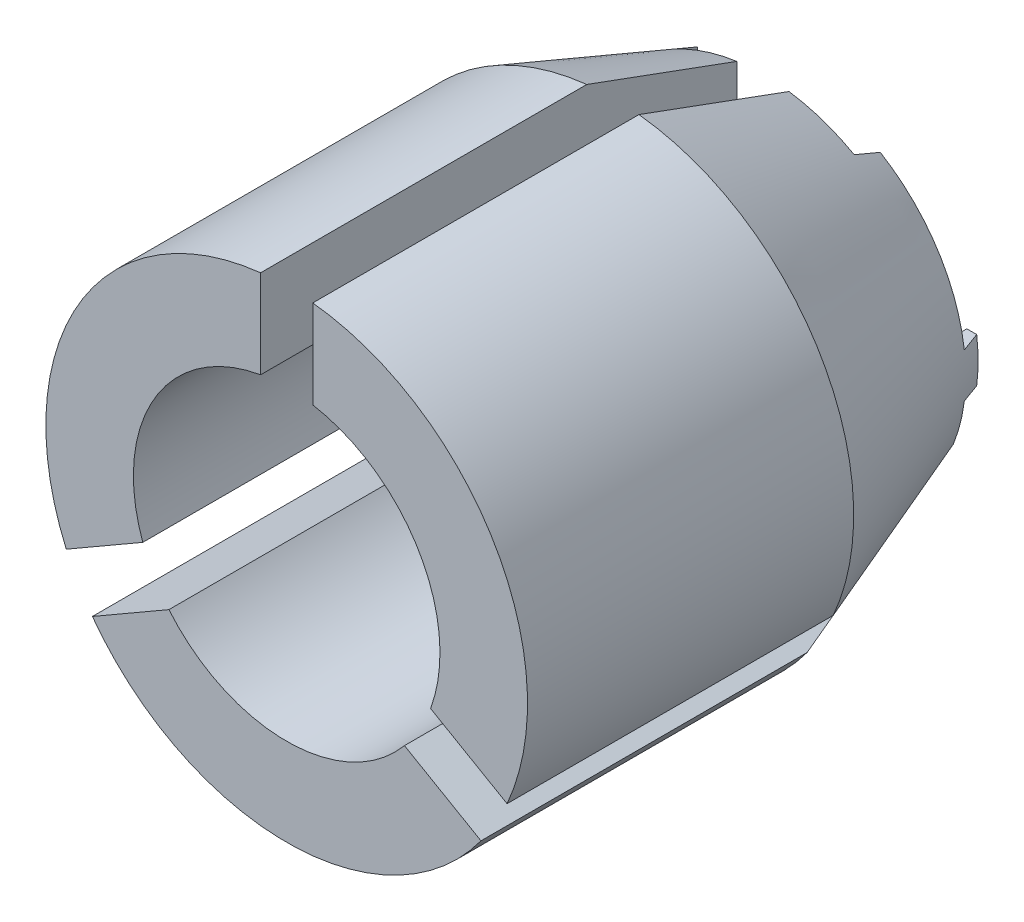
from build123d import *

# Parameters (mm, degrees)
SKIZZE1_R                       = 13
LINEAR_AUSTRAGEN1_DEPTH         = 15
LINEAR_AUSTRAGEN1_DRAFT         = -20
SKIZZE13_R                      = 18.459553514
LINEAR_AUSTRAGEN4_DEPTH         = 25
SKIZZE3_R                       = 12.25
SCHNITT_LINEAR_AUSTRAGEN1_DEPTH = 3.5
SKIZZE4_W                       = 4
SKIZZE4_H                       = 20
SCHNITT_LINEAR_AUSTRAGEN2_DEPTH = 48.76515709
KREISMUSTER3_COUNT              = 3
SKIZZE6_R                       = 11.75
SCHNITT_LINEAR_AUSTRAGEN3_DEPTH = 48.76515709
SCHNITT_LINEAR_AUSTRAGEN5_DEPTH = 1.5
SKIZZE10_W                      = 14
SKIZZE10_H                      = 30
SCHNITT_LINEAR_AUSTRAGEN6_DEPTH = 2


with BuildPart() as part:
    # Skizze1 → Linear austragen1 (with draft: the straight prism first)
    with BuildSketch(Plane.XY):
        Circle(SKIZZE1_R)
    extrude(amount=LINEAR_AUSTRAGEN1_DEPTH)
    # Linear austragen1: the draft: its side faces are tilted about the plane it starts from
    linear_austragen1_sides = [part.faces().sort_by_distance(p)[0] for p in [
        (-13, 0, 7.5),
    ]]
    draft(linear_austragen1_sides, Plane.XY, LINEAR_AUSTRAGEN1_DRAFT)

    # Skizze13 → Linear austragen4 (add)
    with BuildSketch(Plane.XY.offset(15)):
        Circle(SKIZZE13_R)
    extrude(amount=LINEAR_AUSTRAGEN4_DEPTH)

    # Skizze3 → Schnitt-Linear austragen1 (cut)
    with BuildSketch(Plane(origin=(0, 0, 0), x_dir=(-1, 0, 0), z_dir=(0, 0, -1))):
        Circle(SKIZZE3_R)
    extrude(amount=-SCHNITT_LINEAR_AUSTRAGEN1_DEPTH, mode=Mode.SUBTRACT)

    # Skizze4 → Schnitt-Linear austragen2 (cut, through all)
    with BuildSketch(Plane(origin=(0, 0, 0), x_dir=(-1, 0, 0), z_dir=(0, 0, -1))):
        with Locations((0, 15)):
            Rectangle(SKIZZE4_W, SKIZZE4_H)
    schnitt_linear_austragen2 = extrude(amount=-SCHNITT_LINEAR_AUSTRAGEN2_DEPTH, mode=Mode.SUBTRACT)

    # Kreismuster3: Schnitt-Linear austragen2 ×3 about axis
    kreismuster3_axis = Axis((0, 0, 0), (0, 0, 1))
    for i in range(1, KREISMUSTER3_COUNT):
        add(schnitt_linear_austragen2.rotate(kreismuster3_axis, i * 360 / KREISMUSTER3_COUNT), mode=Mode.SUBTRACT)

    # Skizze6 → Schnitt-Linear austragen3 (cut, through all)
    with BuildSketch(Plane(origin=(0, 0, 0), x_dir=(-1, 0, 0), z_dir=(0, 0, -1))):
        Circle(SKIZZE6_R)
    extrude(amount=-SCHNITT_LINEAR_AUSTRAGEN3_DEPTH, mode=Mode.SUBTRACT)


with BuildPart() as schnitt_linear_austragen3_piece_1:
    # of the separate pieces the step leaves, piece 1, a body of its own (schnitt_linear_austragen3_pieces)
    add(part.part.solids().sort_by_distance((2, 11.578536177, 3.5))[0])


with BuildPart() as schnitt_linear_austragen3_piece_2:
    # of the separate pieces the step leaves, piece 2, a body of its own (schnitt_linear_austragen3_pieces)
    add(part.part.solids().sort_by_distance((-2, 12.845232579, 0))[0])


with BuildPart() as schnitt_linear_austragen3_piece_3:
    # of the separate pieces the step leaves, piece 3, a body of its own (schnitt_linear_austragen3_pieces)
    add(part.part.solids().sort_by_distance((-9.466464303, -7.77486679, 3.5))[0])


with BuildPart() as schnitt_linear_austragen5_tool:
    # Skizze7 → Schnitt-Linear austragen5 (new body)
    with BuildSketch(Plane(origin=(0, 0, 0), x_dir=(-1, 0, 0), z_dir=(0, 0, -1))):
        with BuildLine():
            Line((-12.131467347, 1.7), (-18.381107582, 1.7))
            ThreePointArc((-18.381107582, 1.7), (0, 18.459553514), (18.381107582, 1.7))
            Line((18.381107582, 1.7), (12.131467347, 1.7))
            ThreePointArc((12.131467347, 1.7), (0, 12.25), (-12.131467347, 1.7))
        make_face()
        with BuildLine():
            Line((-12.131467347, -1.7), (-18.381107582, -1.7))
            ThreePointArc((-18.381107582, -1.7), (0, -18.459553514), (18.381107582, -1.7))
            Line((18.381107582, -1.7), (12.131467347, -1.7))
            ThreePointArc((12.131467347, -1.7), (0, -12.25), (-12.131467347, -1.7))
        make_face()
    extrude(amount=-SCHNITT_LINEAR_AUSTRAGEN5_DEPTH)


with BuildPart() as schnitt_linear_austragen3_piece_1_1:
    add(schnitt_linear_austragen3_piece_1.part)

    # Schnitt-Linear austragen5: cut by schnitt_linear_austragen5_tool
    add(schnitt_linear_austragen5_tool.part, mode=Mode.SUBTRACT)


with BuildPart() as schnitt_linear_austragen3_piece_2_1:
    add(schnitt_linear_austragen3_piece_2.part)

    # Schnitt-Linear austragen5: cut by schnitt_linear_austragen5_tool
    add(schnitt_linear_austragen5_tool.part, mode=Mode.SUBTRACT)


with BuildPart() as schnitt_linear_austragen3_piece_3_1:
    add(schnitt_linear_austragen3_piece_3.part)

    # Schnitt-Linear austragen5: cut by schnitt_linear_austragen5_tool
    add(schnitt_linear_austragen5_tool.part, mode=Mode.SUBTRACT)


with BuildPart() as schnitt_linear_austragen6_tool:
    # Skizze10 → Schnitt-Linear austragen6 (new body)
    with BuildSketch(Plane(origin=(0, 0, 1.5), x_dir=(-1, 0, 0), z_dir=(0, 0, -1))):
        Rectangle(SKIZZE10_W, SKIZZE10_H)
    extrude(amount=-SCHNITT_LINEAR_AUSTRAGEN6_DEPTH)


with BuildPart() as schnitt_linear_austragen3_piece_1_2:
    add(schnitt_linear_austragen3_piece_1_1.part)

    # Schnitt-Linear austragen6: cut by schnitt_linear_austragen6_tool
    add(schnitt_linear_austragen6_tool.part, mode=Mode.SUBTRACT)


with BuildPart() as schnitt_linear_austragen3_piece_2_2:
    add(schnitt_linear_austragen3_piece_2_1.part)

    # Schnitt-Linear austragen6: cut by schnitt_linear_austragen6_tool
    add(schnitt_linear_austragen6_tool.part, mode=Mode.SUBTRACT)


with BuildPart() as schnitt_linear_austragen3_piece_3_2:
    add(schnitt_linear_austragen3_piece_3_1.part)

    # Schnitt-Linear austragen6: cut by schnitt_linear_austragen6_tool
    add(schnitt_linear_austragen6_tool.part, mode=Mode.SUBTRACT)


solid = Compound([schnitt_linear_austragen3_piece_1_2.part, schnitt_linear_austragen3_piece_2_2.part, schnitt_linear_austragen3_piece_3_2.part])
